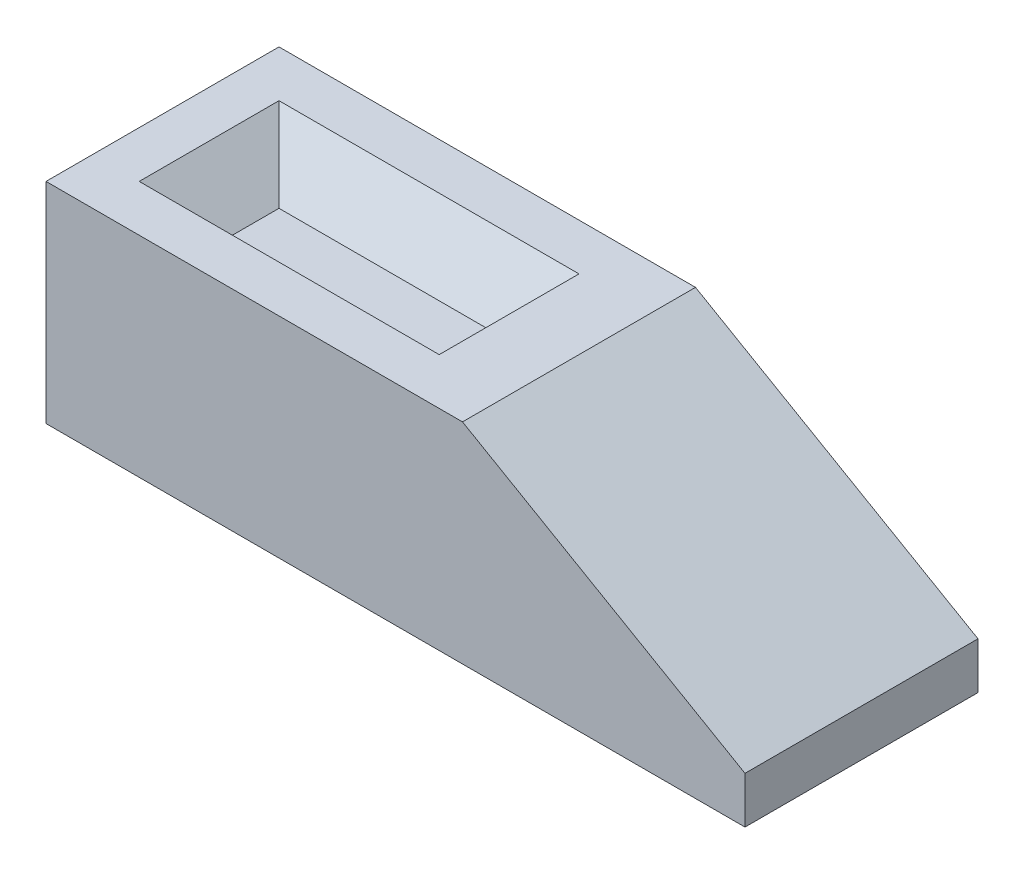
from build123d import *

# Parameters (mm, degrees)
EXTRUDE1_DEPTH     = 25
SKETCH2_W          = 64.378221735
SKETCH2_H          = 30
CUT_EXTRUDE1_DEPTH = 10
CUT_EXTRUDE1_DRAFT = -45


with BuildPart() as part:
    # Sketch1 → Extrude1 (new, symmetric)
    with BuildSketch(Plane.XY):
        Polygon((0, 0), (0, 10), (-60.621778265, 45), (-150, 45), (-150, 0), align=None)
    extrude(amount=EXTRUDE1_DEPTH, both=True)


with BuildPart() as cut_extrude1_tool:
    # Sketch2 → Cut-Extrude1 (with draft: the straight prism first)
    with BuildSketch(Plane(origin=(0, 45, 0), x_dir=(-1, 0, 0), z_dir=(0, 1, 0))):
        with Locations((107.810889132, 0)):
            Rectangle(SKETCH2_W, SKETCH2_H)
    extrude(amount=-CUT_EXTRUDE1_DEPTH)
    # Cut-Extrude1: the draft: its side faces are tilted about the plane it starts from
    cut_extrude1_sides = [cut_extrude1_tool.faces().sort_by_distance(p)[0] for p in [
        (-107.810889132, 40, -15),
        (-140, 40, 0),
        (-107.810889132, 40, 15),
        (-75.621778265, 40, 0),
    ]]
    draft(cut_extrude1_sides, Plane(origin=(0, 45, 0), x_dir=(-1, 0, 0), z_dir=(0, 1, 0)), CUT_EXTRUDE1_DRAFT)


with BuildPart() as part_1:
    add(part.part)

    # Cut-Extrude1: cut by cut_extrude1_tool
    add(cut_extrude1_tool.part, mode=Mode.SUBTRACT)


solid = part_1.part
